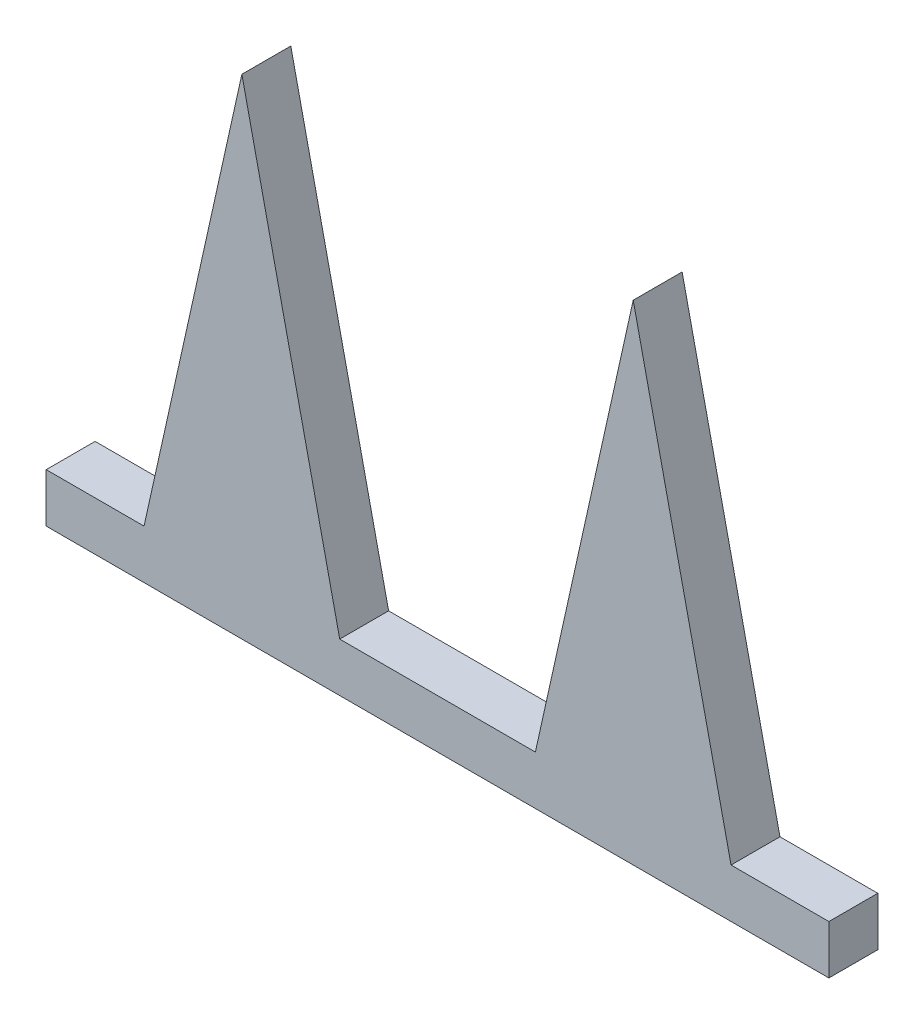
ISO-10303-21;
HEADER;
FILE_DESCRIPTION(('STEP AP214'),'2;1');
FILE_NAME('part.step','',(''),(''),'','','');
FILE_SCHEMA(('AUTOMOTIVE_DESIGN { 1 0 10303 214 1 1 1 1 }'));
ENDSEC;
DATA;
#1=APPLICATION_CONTEXT('core data for automotive mechanical design processes');
#2=APPLICATION_PROTOCOL_DEFINITION('international standard','automotive_design',2000,#1);
#3=PRODUCT_CONTEXT('',#1,'mechanical');
#4=PRODUCT('Part','Part','',(#3));
#5=PRODUCT_RELATED_PRODUCT_CATEGORY('part','',(#4));
#6=PRODUCT_DEFINITION_FORMATION('','',#4);
#7=PRODUCT_DEFINITION_CONTEXT('part definition',#1,'design');
#8=PRODUCT_DEFINITION('design','',#6,#7);
#9=PRODUCT_DEFINITION_SHAPE('','',#8);
#10=(LENGTH_UNIT() NAMED_UNIT(*) SI_UNIT(.MILLI.,.METRE.));
#11=(NAMED_UNIT(*) PLANE_ANGLE_UNIT() SI_UNIT($,.RADIAN.));
#12=(NAMED_UNIT(*) SI_UNIT($,.STERADIAN.) SOLID_ANGLE_UNIT());
#13=UNCERTAINTY_MEASURE_WITH_UNIT(LENGTH_MEASURE(1.E-05),#10,'distance_accuracy_value','');
#14=(GEOMETRIC_REPRESENTATION_CONTEXT(3) GLOBAL_UNCERTAINTY_ASSIGNED_CONTEXT((#13)) GLOBAL_UNIT_ASSIGNED_CONTEXT((#10,
#11,#12)) REPRESENTATION_CONTEXT('',''));
#15=CARTESIAN_POINT('',(0.,0.,0.));
#16=DIRECTION('',(0.,0.,1.));
#17=DIRECTION('',(1.,0.,0.));
#18=AXIS2_PLACEMENT_3D('',#15,#16,#17);
#19=CARTESIAN_POINT('',(0.,0.,10.));
#20=DIRECTION('',(1.,0.,0.));
#21=DIRECTION('',(0.,0.,-1.));
#22=AXIS2_PLACEMENT_3D('',#19,#20,#21);
#23=PLANE('',#22);
#24=DIRECTION('',(0.,-1.,0.));
#25=VECTOR('',#24,1.);
#26=CARTESIAN_POINT('',(0.,0.,0.));
#27=LINE('',#26,#25);
#28=CARTESIAN_POINT('',(0.,10.,0.));
#29=VERTEX_POINT('',#28);
#30=CARTESIAN_POINT('',(0.,0.,0.));
#31=VERTEX_POINT('',#30);
#32=EDGE_CURVE('E141',#29,#31,#27,.T.);
#33=ORIENTED_EDGE('',*,*,#32,.T.);
#34=DIRECTION('',(0.,0.,-1.));
#35=VECTOR('',#34,1.);
#36=CARTESIAN_POINT('',(0.,0.,10.));
#37=LINE('',#36,#35);
#38=CARTESIAN_POINT('',(0.,0.,10.));
#39=VERTEX_POINT('',#38);
#40=EDGE_CURVE('E11',#39,#31,#37,.T.);
#41=ORIENTED_EDGE('',*,*,#40,.F.);
#42=DIRECTION('',(0.,-1.,0.));
#43=VECTOR('',#42,1.);
#44=CARTESIAN_POINT('',(0.,0.,10.));
#45=LINE('',#44,#43);
#46=CARTESIAN_POINT('',(0.,10.,10.));
#47=VERTEX_POINT('',#46);
#48=EDGE_CURVE('E159',#47,#39,#45,.T.);
#49=ORIENTED_EDGE('',*,*,#48,.F.);
#50=DIRECTION('',(0.,0.,-1.));
#51=VECTOR('',#50,1.);
#52=CARTESIAN_POINT('',(0.,10.,10.));
#53=LINE('',#52,#51);
#54=EDGE_CURVE('E137',#47,#29,#53,.T.);
#55=ORIENTED_EDGE('',*,*,#54,.T.);
#56=EDGE_LOOP('',(#33,#41,#49,#55));
#57=FACE_BOUND('',#56,.T.);
#58=ADVANCED_FACE('F33',(#57),#23,.F.);
#59=CARTESIAN_POINT('',(0.,0.,10.));
#60=DIRECTION('',(0.,1.,0.));
#61=DIRECTION('',(0.,0.,1.));
#62=AXIS2_PLACEMENT_3D('',#59,#60,#61);
#63=PLANE('',#62);
#64=DIRECTION('',(1.,0.,0.));
#65=VECTOR('',#64,1.);
#66=CARTESIAN_POINT('',(0.,0.,0.));
#67=LINE('',#66,#65);
#68=CARTESIAN_POINT('',(160.,0.,0.));
#69=VERTEX_POINT('',#68);
#70=EDGE_CURVE('E144',#31,#69,#67,.T.);
#71=ORIENTED_EDGE('',*,*,#70,.T.);
#72=DIRECTION('',(0.,0.,-1.));
#73=VECTOR('',#72,1.);
#74=CARTESIAN_POINT('',(160.,0.,10.));
#75=LINE('',#74,#73);
#76=CARTESIAN_POINT('',(160.,0.,10.));
#77=VERTEX_POINT('',#76);
#78=EDGE_CURVE('E41',#77,#69,#75,.T.);
#79=ORIENTED_EDGE('',*,*,#78,.F.);
#80=DIRECTION('',(1.,0.,0.));
#81=VECTOR('',#80,1.);
#82=CARTESIAN_POINT('',(0.,0.,10.));
#83=LINE('',#82,#81);
#84=EDGE_CURVE('E98',#39,#77,#83,.T.);
#85=ORIENTED_EDGE('',*,*,#84,.F.);
#86=ORIENTED_EDGE('',*,*,#40,.T.);
#87=EDGE_LOOP('',(#71,#79,#85,#86));
#88=FACE_BOUND('',#87,.T.);
#89=ADVANCED_FACE('F208',(#88),#63,.F.);
#90=CARTESIAN_POINT('',(160.,0.,10.));
#91=DIRECTION('',(-1.,0.,0.));
#92=DIRECTION('',(0.,0.,1.));
#93=AXIS2_PLACEMENT_3D('',#90,#91,#92);
#94=PLANE('',#93);
#95=DIRECTION('',(0.,1.,0.));
#96=VECTOR('',#95,1.);
#97=CARTESIAN_POINT('',(160.,0.,0.));
#98=LINE('',#97,#96);
#99=CARTESIAN_POINT('',(160.,10.,0.));
#100=VERTEX_POINT('',#99);
#101=EDGE_CURVE('E146',#69,#100,#98,.T.);
#102=ORIENTED_EDGE('',*,*,#101,.T.);
#103=DIRECTION('',(0.,0.,-1.));
#104=VECTOR('',#103,1.);
#105=CARTESIAN_POINT('',(160.,10.,10.));
#106=LINE('',#105,#104);
#107=CARTESIAN_POINT('',(160.,10.,10.));
#108=VERTEX_POINT('',#107);
#109=EDGE_CURVE('E172',#108,#100,#106,.T.);
#110=ORIENTED_EDGE('',*,*,#109,.F.);
#111=DIRECTION('',(0.,1.,0.));
#112=VECTOR('',#111,1.);
#113=CARTESIAN_POINT('',(160.,0.,10.));
#114=LINE('',#113,#112);
#115=EDGE_CURVE('E180',#77,#108,#114,.T.);
#116=ORIENTED_EDGE('',*,*,#115,.F.);
#117=ORIENTED_EDGE('',*,*,#78,.T.);
#118=EDGE_LOOP('',(#102,#110,#116,#117));
#119=FACE_BOUND('',#118,.T.);
#120=ADVANCED_FACE('F178',(#119),#94,.F.);
#121=CARTESIAN_POINT('',(140.,10.,10.));
#122=DIRECTION('',(0.,-1.,0.));
#123=DIRECTION('',(0.,0.,-1.));
#124=AXIS2_PLACEMENT_3D('',#121,#122,#123);
#125=PLANE('',#124);
#126=DIRECTION('',(-1.,0.,0.));
#127=VECTOR('',#126,1.);
#128=CARTESIAN_POINT('',(140.,10.,0.));
#129=LINE('',#128,#127);
#130=CARTESIAN_POINT('',(140.,10.,0.));
#131=VERTEX_POINT('',#130);
#132=EDGE_CURVE('E148',#100,#131,#129,.T.);
#133=ORIENTED_EDGE('',*,*,#132,.T.);
#134=DIRECTION('',(0.,0.,-1.));
#135=VECTOR('',#134,1.);
#136=CARTESIAN_POINT('',(140.,10.,10.));
#137=LINE('',#136,#135);
#138=CARTESIAN_POINT('',(140.,10.,10.));
#139=VERTEX_POINT('',#138);
#140=EDGE_CURVE('E169',#139,#131,#137,.T.);
#141=ORIENTED_EDGE('',*,*,#140,.F.);
#142=DIRECTION('',(-1.,0.,0.));
#143=VECTOR('',#142,1.);
#144=CARTESIAN_POINT('',(140.,10.,10.));
#145=LINE('',#144,#143);
#146=EDGE_CURVE('E198',#108,#139,#145,.T.);
#147=ORIENTED_EDGE('',*,*,#146,.F.);
#148=ORIENTED_EDGE('',*,*,#109,.T.);
#149=EDGE_LOOP('',(#133,#141,#147,#148));
#150=FACE_BOUND('',#149,.T.);
#151=ADVANCED_FACE('F189',(#150),#125,.F.);
#152=CARTESIAN_POINT('',(120.,100.,10.));
#153=DIRECTION('',(-0.976187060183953,-0.216930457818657,0.));
#154=DIRECTION('',(0.216930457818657,-0.976187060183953,0.));
#155=AXIS2_PLACEMENT_3D('',#152,#153,#154);
#156=PLANE('',#155);
#157=DIRECTION('',(-0.216930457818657,0.976187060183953,0.));
#158=VECTOR('',#157,1.);
#159=CARTESIAN_POINT('',(120.,100.,0.));
#160=LINE('',#159,#158);
#161=CARTESIAN_POINT('',(120.,100.,0.));
#162=VERTEX_POINT('',#161);
#163=EDGE_CURVE('E150',#131,#162,#160,.T.);
#164=ORIENTED_EDGE('',*,*,#163,.T.);
#165=DIRECTION('',(0.,0.,-1.));
#166=VECTOR('',#165,1.);
#167=CARTESIAN_POINT('',(120.,100.,10.));
#168=LINE('',#167,#166);
#169=CARTESIAN_POINT('',(120.,100.,10.));
#170=VERTEX_POINT('',#169);
#171=EDGE_CURVE('E166',#170,#162,#168,.T.);
#172=ORIENTED_EDGE('',*,*,#171,.F.);
#173=DIRECTION('',(-0.216930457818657,0.976187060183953,0.));
#174=VECTOR('',#173,1.);
#175=CARTESIAN_POINT('',(120.,100.,10.));
#176=LINE('',#175,#174);
#177=EDGE_CURVE('E195',#139,#170,#176,.T.);
#178=ORIENTED_EDGE('',*,*,#177,.F.);
#179=ORIENTED_EDGE('',*,*,#140,.T.);
#180=EDGE_LOOP('',(#164,#172,#178,#179));
#181=FACE_BOUND('',#180,.T.);
#182=ADVANCED_FACE('F193',(#181),#156,.F.);
#183=CARTESIAN_POINT('',(100.,10.,10.));
#184=DIRECTION('',(0.976187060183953,-0.216930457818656,0.));
#185=DIRECTION('',(0.216930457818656,0.976187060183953,0.));
#186=AXIS2_PLACEMENT_3D('',#183,#184,#185);
#187=PLANE('',#186);
#188=DIRECTION('',(-0.216930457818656,-0.976187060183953,0.));
#189=VECTOR('',#188,1.);
#190=CARTESIAN_POINT('',(100.,10.,0.));
#191=LINE('',#190,#189);
#192=CARTESIAN_POINT('',(100.,10.,0.));
#193=VERTEX_POINT('',#192);
#194=EDGE_CURVE('E152',#162,#193,#191,.T.);
#195=ORIENTED_EDGE('',*,*,#194,.T.);
#196=DIRECTION('',(0.,0.,-1.));
#197=VECTOR('',#196,1.);
#198=CARTESIAN_POINT('',(100.,10.,10.));
#199=LINE('',#198,#197);
#200=CARTESIAN_POINT('',(100.,10.,10.));
#201=VERTEX_POINT('',#200);
#202=EDGE_CURVE('E163',#201,#193,#199,.T.);
#203=ORIENTED_EDGE('',*,*,#202,.F.);
#204=DIRECTION('',(-0.216930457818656,-0.976187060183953,0.));
#205=VECTOR('',#204,1.);
#206=CARTESIAN_POINT('',(100.,10.,10.));
#207=LINE('',#206,#205);
#208=EDGE_CURVE('E197',#170,#201,#207,.T.);
#209=ORIENTED_EDGE('',*,*,#208,.F.);
#210=ORIENTED_EDGE('',*,*,#171,.T.);
#211=EDGE_LOOP('',(#195,#203,#209,#210));
#212=FACE_BOUND('',#211,.T.);
#213=ADVANCED_FACE('F220',(#212),#187,.F.);
#214=CARTESIAN_POINT('',(60.,10.,10.));
#215=DIRECTION('',(0.,-1.,0.));
#216=DIRECTION('',(0.,0.,-1.));
#217=AXIS2_PLACEMENT_3D('',#214,#215,#216);
#218=PLANE('',#217);
#219=DIRECTION('',(-1.,0.,0.));
#220=VECTOR('',#219,1.);
#221=CARTESIAN_POINT('',(60.,10.,0.));
#222=LINE('',#221,#220);
#223=CARTESIAN_POINT('',(60.,10.,0.));
#224=VERTEX_POINT('',#223);
#225=EDGE_CURVE('E154',#193,#224,#222,.T.);
#226=ORIENTED_EDGE('',*,*,#225,.T.);
#227=DIRECTION('',(0.,0.,-1.));
#228=VECTOR('',#227,1.);
#229=CARTESIAN_POINT('',(60.,10.,10.));
#230=LINE('',#229,#228);
#231=CARTESIAN_POINT('',(60.,10.,10.));
#232=VERTEX_POINT('',#231);
#233=EDGE_CURVE('E132',#232,#224,#230,.T.);
#234=ORIENTED_EDGE('',*,*,#233,.F.);
#235=DIRECTION('',(-1.,0.,0.));
#236=VECTOR('',#235,1.);
#237=CARTESIAN_POINT('',(60.,10.,10.));
#238=LINE('',#237,#236);
#239=EDGE_CURVE('E123',#201,#232,#238,.T.);
#240=ORIENTED_EDGE('',*,*,#239,.F.);
#241=ORIENTED_EDGE('',*,*,#202,.T.);
#242=EDGE_LOOP('',(#226,#234,#240,#241));
#243=FACE_BOUND('',#242,.T.);
#244=ADVANCED_FACE('F223',(#243),#218,.F.);
#245=CARTESIAN_POINT('',(40.,100.,10.));
#246=DIRECTION('',(-0.976187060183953,-0.216930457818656,0.));
#247=DIRECTION('',(0.216930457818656,-0.976187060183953,0.));
#248=AXIS2_PLACEMENT_3D('',#245,#246,#247);
#249=PLANE('',#248);
#250=DIRECTION('',(-0.216930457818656,0.976187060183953,0.));
#251=VECTOR('',#250,1.);
#252=CARTESIAN_POINT('',(40.,100.,0.));
#253=LINE('',#252,#251);
#254=CARTESIAN_POINT('',(40.,100.,0.));
#255=VERTEX_POINT('',#254);
#256=EDGE_CURVE('E131',#224,#255,#253,.T.);
#257=ORIENTED_EDGE('',*,*,#256,.T.);
#258=DIRECTION('',(0.,0.,-1.));
#259=VECTOR('',#258,1.);
#260=CARTESIAN_POINT('',(40.,100.,10.));
#261=LINE('',#260,#259);
#262=CARTESIAN_POINT('',(40.,100.,10.));
#263=VERTEX_POINT('',#262);
#264=EDGE_CURVE('E128',#263,#255,#261,.T.);
#265=ORIENTED_EDGE('',*,*,#264,.F.);
#266=DIRECTION('',(-0.216930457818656,0.976187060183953,0.));
#267=VECTOR('',#266,1.);
#268=CARTESIAN_POINT('',(40.,100.,10.));
#269=LINE('',#268,#267);
#270=EDGE_CURVE('E117',#232,#263,#269,.T.);
#271=ORIENTED_EDGE('',*,*,#270,.F.);
#272=ORIENTED_EDGE('',*,*,#233,.T.);
#273=EDGE_LOOP('',(#257,#265,#271,#272));
#274=FACE_BOUND('',#273,.T.);
#275=ADVANCED_FACE('F129',(#274),#249,.F.);
#276=CARTESIAN_POINT('',(20.,10.,10.));
#277=DIRECTION('',(0.976187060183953,-0.216930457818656,0.));
#278=DIRECTION('',(0.216930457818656,0.976187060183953,0.));
#279=AXIS2_PLACEMENT_3D('',#276,#277,#278);
#280=PLANE('',#279);
#281=DIRECTION('',(-0.216930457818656,-0.976187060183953,0.));
#282=VECTOR('',#281,1.);
#283=CARTESIAN_POINT('',(20.,10.,0.));
#284=LINE('',#283,#282);
#285=CARTESIAN_POINT('',(20.,10.,0.));
#286=VERTEX_POINT('',#285);
#287=EDGE_CURVE('E84',#255,#286,#284,.T.);
#288=ORIENTED_EDGE('',*,*,#287,.T.);
#289=DIRECTION('',(0.,0.,-1.));
#290=VECTOR('',#289,1.);
#291=CARTESIAN_POINT('',(20.,10.,10.));
#292=LINE('',#291,#290);
#293=CARTESIAN_POINT('',(20.,10.,10.));
#294=VERTEX_POINT('',#293);
#295=EDGE_CURVE('E133',#294,#286,#292,.T.);
#296=ORIENTED_EDGE('',*,*,#295,.F.);
#297=DIRECTION('',(-0.216930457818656,-0.976187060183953,0.));
#298=VECTOR('',#297,1.);
#299=CARTESIAN_POINT('',(20.,10.,10.));
#300=LINE('',#299,#298);
#301=EDGE_CURVE('E121',#263,#294,#300,.T.);
#302=ORIENTED_EDGE('',*,*,#301,.F.);
#303=ORIENTED_EDGE('',*,*,#264,.T.);
#304=EDGE_LOOP('',(#288,#296,#302,#303));
#305=FACE_BOUND('',#304,.T.);
#306=ADVANCED_FACE('F135',(#305),#280,.F.);
#307=CARTESIAN_POINT('',(0.,10.,10.));
#308=DIRECTION('',(0.,-1.,0.));
#309=DIRECTION('',(0.,0.,-1.));
#310=AXIS2_PLACEMENT_3D('',#307,#308,#309);
#311=PLANE('',#310);
#312=DIRECTION('',(-1.,0.,0.));
#313=VECTOR('',#312,1.);
#314=CARTESIAN_POINT('',(0.,10.,0.));
#315=LINE('',#314,#313);
#316=EDGE_CURVE('E90',#286,#29,#315,.T.);
#317=ORIENTED_EDGE('',*,*,#316,.T.);
#318=ORIENTED_EDGE('',*,*,#54,.F.);
#319=DIRECTION('',(-1.,0.,0.));
#320=VECTOR('',#319,1.);
#321=CARTESIAN_POINT('',(0.,10.,10.));
#322=LINE('',#321,#320);
#323=EDGE_CURVE('E49',#294,#47,#322,.T.);
#324=ORIENTED_EDGE('',*,*,#323,.F.);
#325=ORIENTED_EDGE('',*,*,#295,.T.);
#326=EDGE_LOOP('',(#317,#318,#324,#325));
#327=FACE_BOUND('',#326,.T.);
#328=ADVANCED_FACE('F232',(#327),#311,.F.);
#329=CARTESIAN_POINT('',(0.,10.,10.));
#330=DIRECTION('',(0.,0.,-1.));
#331=DIRECTION('',(-1.,0.,0.));
#332=AXIS2_PLACEMENT_3D('',#329,#330,#331);
#333=PLANE('',#332);
#334=ORIENTED_EDGE('',*,*,#48,.T.);
#335=ORIENTED_EDGE('',*,*,#84,.T.);
#336=ORIENTED_EDGE('',*,*,#115,.T.);
#337=ORIENTED_EDGE('',*,*,#146,.T.);
#338=ORIENTED_EDGE('',*,*,#177,.T.);
#339=ORIENTED_EDGE('',*,*,#208,.T.);
#340=ORIENTED_EDGE('',*,*,#239,.T.);
#341=ORIENTED_EDGE('',*,*,#270,.T.);
#342=ORIENTED_EDGE('',*,*,#301,.T.);
#343=ORIENTED_EDGE('',*,*,#323,.T.);
#344=EDGE_LOOP('',(#334,#335,#336,#337,#338,#339,#340,#341,#342,#343));
#345=FACE_BOUND('',#344,.T.);
#346=ADVANCED_FACE('F119',(#345),#333,.F.);
#347=CARTESIAN_POINT('',(0.,10.,0.));
#348=DIRECTION('',(0.,0.,-1.));
#349=DIRECTION('',(-1.,0.,0.));
#350=AXIS2_PLACEMENT_3D('',#347,#348,#349);
#351=PLANE('',#350);
#352=ORIENTED_EDGE('',*,*,#32,.F.);
#353=ORIENTED_EDGE('',*,*,#316,.F.);
#354=ORIENTED_EDGE('',*,*,#287,.F.);
#355=ORIENTED_EDGE('',*,*,#256,.F.);
#356=ORIENTED_EDGE('',*,*,#225,.F.);
#357=ORIENTED_EDGE('',*,*,#194,.F.);
#358=ORIENTED_EDGE('',*,*,#163,.F.);
#359=ORIENTED_EDGE('',*,*,#132,.F.);
#360=ORIENTED_EDGE('',*,*,#101,.F.);
#361=ORIENTED_EDGE('',*,*,#70,.F.);
#362=EDGE_LOOP('',(#352,#353,#354,#355,#356,#357,#358,#359,#360,#361));
#363=FACE_BOUND('',#362,.T.);
#364=ADVANCED_FACE('F184',(#363),#351,.T.);
#365=CLOSED_SHELL('',(#58,#89,#120,#151,#182,#213,#244,#275,#306,#328,#346,#364));
#366=MANIFOLD_SOLID_BREP('B2',#365);
#367=ADVANCED_BREP_SHAPE_REPRESENTATION('',(#18,#366),#14);
#368=SHAPE_DEFINITION_REPRESENTATION(#9,#367);
ENDSEC;
END-ISO-10303-21;
